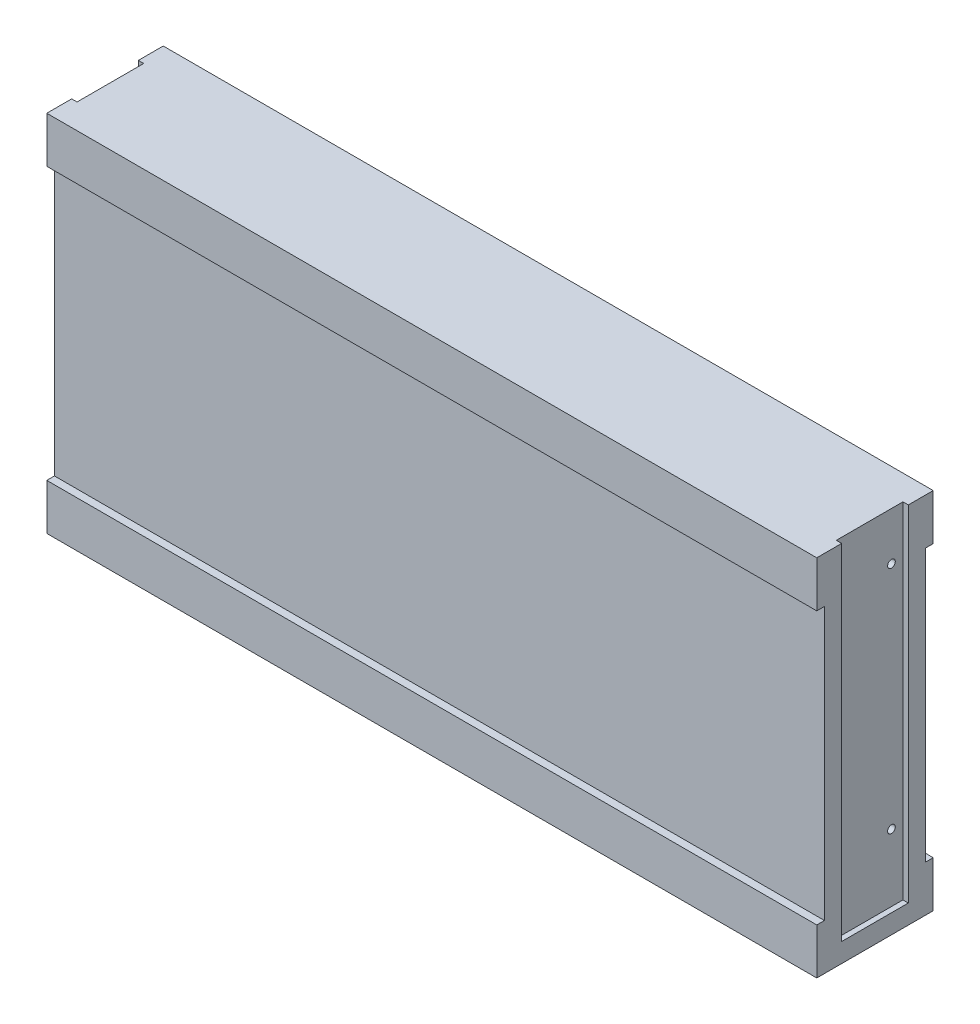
from build123d import *

# Parameters (mm, degrees)
SKETCH1_W           = 201
SKETCH1_H           = 95
BOSS_EXTRUDE1_DEPTH = 30.4
SKETCH2_R           = 1
CUT_EXTRUDE1_DEPTH  = 201
SKETCH5_W           = 2
SKETCH5_H           = 71
CUT_EXTRUDE4_DEPTH  = 201
SKETCH4_W           = 17.4
SKETCH4_H           = 90
CUT_EXTRUDE5_DEPTH  = 1.4
SKETCH3_W           = 17.4
SKETCH3_H           = 90
CUT_EXTRUDE6_DEPTH  = 1.4


with BuildPart() as part:
    # Sketch1 → Boss-Extrude1 (new body)
    with BuildSketch(Plane.XY):
        with Locations((-35.951219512, -4.399390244)):
            Rectangle(SKETCH1_W, SKETCH1_H)
    extrude(amount=BOSS_EXTRUDE1_DEPTH)

    # Sketch2 → Cut-Extrude1 (cut)
    with BuildSketch(Plane(origin=(64.548780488, 0, 0), x_dir=(0, 0, -1), z_dir=(1, 0, 0))):
        with Locations((-9.5, -29.399390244)):
            Circle(SKETCH2_R)
        with Locations((-9.5, 30.600609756)):
            Circle(SKETCH2_R)
    extrude(amount=-CUT_EXTRUDE1_DEPTH, mode=Mode.SUBTRACT)

    # Sketch5 → Cut-Extrude4 (cut)
    with BuildSketch(Plane(origin=(64.548780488, 0, 0), x_dir=(0, 0, -1), z_dir=(1, 0, 0))):
        with Locations((-29.4, -4.399390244)):
            Rectangle(SKETCH5_W, SKETCH5_H)
        with Locations((-1, -4.399390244)):
            Rectangle(SKETCH5_W, SKETCH5_H)
    extrude(amount=-CUT_EXTRUDE4_DEPTH, mode=Mode.SUBTRACT)

    # Sketch4 → Cut-Extrude5 (cut)
    with BuildSketch(Plane.ZY.offset(136.451219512)):
        with Locations((15.2, -1.899390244)):
            Rectangle(SKETCH4_W, SKETCH4_H)
    extrude(amount=-CUT_EXTRUDE5_DEPTH, mode=Mode.SUBTRACT)

    # Sketch3 → Cut-Extrude6 (cut)
    with BuildSketch(Plane(origin=(64.548780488, 0, 0), x_dir=(0, 0, -1), z_dir=(1, 0, 0))):
        with Locations((-15.2, -1.899390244)):
            Rectangle(SKETCH3_W, SKETCH3_H)
    extrude(amount=-CUT_EXTRUDE6_DEPTH, mode=Mode.SUBTRACT)


solid = part.part
